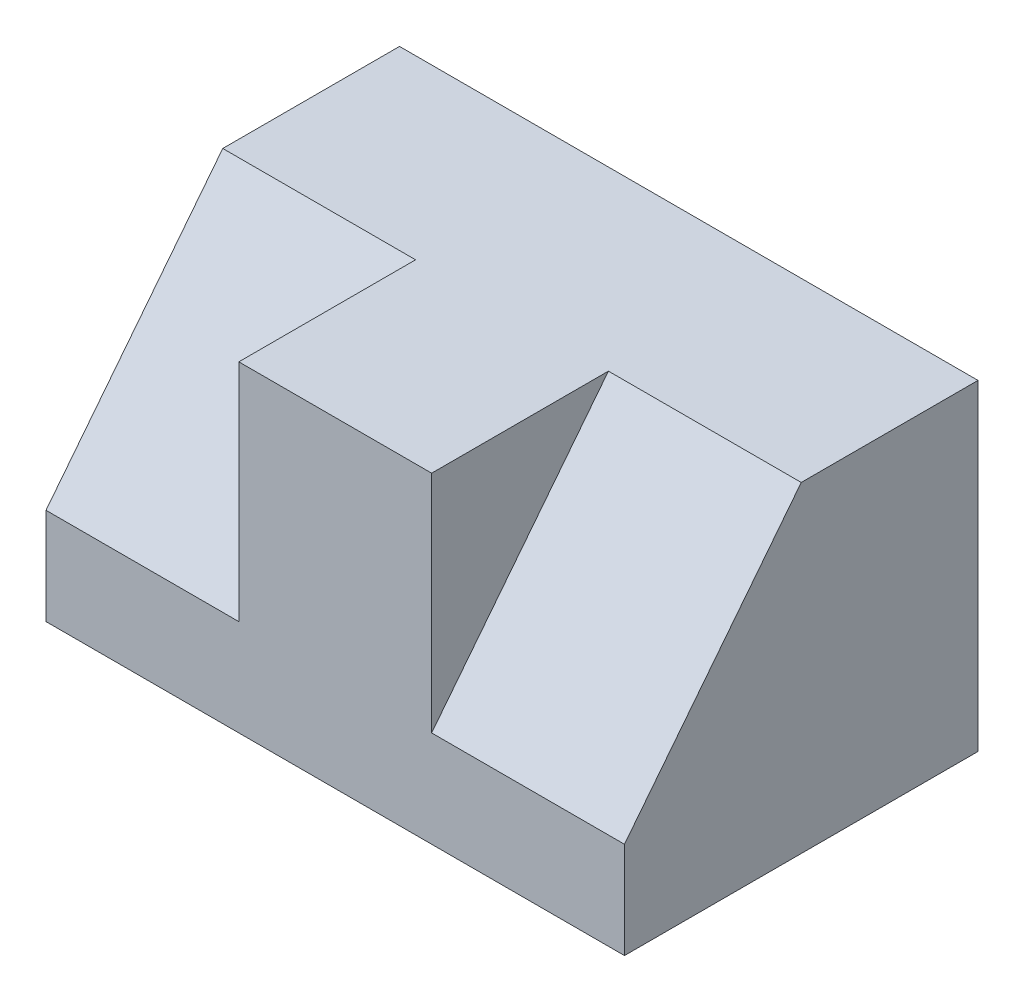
ISO-10303-21;
HEADER;
FILE_DESCRIPTION(('STEP AP214'),'2;1');
FILE_NAME('part.step','',(''),(''),'','','');
FILE_SCHEMA(('AUTOMOTIVE_DESIGN { 1 0 10303 214 1 1 1 1 }'));
ENDSEC;
DATA;
#1=APPLICATION_CONTEXT('core data for automotive mechanical design processes');
#2=APPLICATION_PROTOCOL_DEFINITION('international standard','automotive_design',2000,#1);
#3=PRODUCT_CONTEXT('',#1,'mechanical');
#4=PRODUCT('Part','Part','',(#3));
#5=PRODUCT_RELATED_PRODUCT_CATEGORY('part','',(#4));
#6=PRODUCT_DEFINITION_FORMATION('','',#4);
#7=PRODUCT_DEFINITION_CONTEXT('part definition',#1,'design');
#8=PRODUCT_DEFINITION('design','',#6,#7);
#9=PRODUCT_DEFINITION_SHAPE('','',#8);
#10=(LENGTH_UNIT() NAMED_UNIT(*) SI_UNIT(.MILLI.,.METRE.));
#11=(NAMED_UNIT(*) PLANE_ANGLE_UNIT() SI_UNIT($,.RADIAN.));
#12=(NAMED_UNIT(*) SI_UNIT($,.STERADIAN.) SOLID_ANGLE_UNIT());
#13=UNCERTAINTY_MEASURE_WITH_UNIT(LENGTH_MEASURE(1.E-05),#10,'distance_accuracy_value','');
#14=(GEOMETRIC_REPRESENTATION_CONTEXT(3) GLOBAL_UNCERTAINTY_ASSIGNED_CONTEXT((#13)) GLOBAL_UNIT_ASSIGNED_CONTEXT((#10,
#11,#12)) REPRESENTATION_CONTEXT('',''));
#15=CARTESIAN_POINT('',(0.,0.,0.));
#16=DIRECTION('',(0.,0.,1.));
#17=DIRECTION('',(1.,0.,0.));
#18=AXIS2_PLACEMENT_3D('',#15,#16,#17);
#19=CARTESIAN_POINT('',(0.,50.,0.));
#20=DIRECTION('',(1.,0.,0.));
#21=DIRECTION('',(0.,0.,-1.));
#22=AXIS2_PLACEMENT_3D('',#19,#20,#21);
#23=PLANE('',#22);
#24=DIRECTION('',(0.,-1.,0.));
#25=VECTOR('',#24,1.);
#26=CARTESIAN_POINT('',(0.,50.,0.));
#27=LINE('',#26,#25);
#28=CARTESIAN_POINT('',(0.,15.,0.));
#29=VERTEX_POINT('',#28);
#30=CARTESIAN_POINT('',(0.,0.,0.));
#31=VERTEX_POINT('',#30);
#32=EDGE_CURVE('E11',#29,#31,#27,.T.);
#33=ORIENTED_EDGE('',*,*,#32,.F.);
#34=DIRECTION('',(0.,-0.786318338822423,0.617821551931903));
#35=VECTOR('',#34,1.);
#36=CARTESIAN_POINT('',(0.,15.,0.));
#37=LINE('',#36,#35);
#38=CARTESIAN_POINT('',(0.,50.,-27.5));
#39=VERTEX_POINT('',#38);
#40=EDGE_CURVE('E171',#39,#29,#37,.T.);
#41=ORIENTED_EDGE('',*,*,#40,.F.);
#42=DIRECTION('',(0.,0.,1.));
#43=VECTOR('',#42,1.);
#44=CARTESIAN_POINT('',(0.,50.,0.));
#45=LINE('',#44,#43);
#46=CARTESIAN_POINT('',(0.,50.,-55.));
#47=VERTEX_POINT('',#46);
#48=EDGE_CURVE('E111',#47,#39,#45,.T.);
#49=ORIENTED_EDGE('',*,*,#48,.F.);
#50=DIRECTION('',(0.,-1.,0.));
#51=VECTOR('',#50,1.);
#52=CARTESIAN_POINT('',(0.,50.,-55.));
#53=LINE('',#52,#51);
#54=CARTESIAN_POINT('',(0.,0.,-55.));
#55=VERTEX_POINT('',#54);
#56=EDGE_CURVE('E137',#47,#55,#53,.T.);
#57=ORIENTED_EDGE('',*,*,#56,.T.);
#58=DIRECTION('',(0.,0.,1.));
#59=VECTOR('',#58,1.);
#60=CARTESIAN_POINT('',(0.,0.,0.));
#61=LINE('',#60,#59);
#62=EDGE_CURVE('E127',#55,#31,#61,.T.);
#63=ORIENTED_EDGE('',*,*,#62,.T.);
#64=EDGE_LOOP('',(#33,#41,#49,#57,#63));
#65=FACE_BOUND('',#64,.T.);
#66=ADVANCED_FACE('F31',(#65),#23,.F.);
#67=CARTESIAN_POINT('',(0.,50.,0.));
#68=DIRECTION('',(0.,0.,-1.));
#69=DIRECTION('',(-1.,0.,0.));
#70=AXIS2_PLACEMENT_3D('',#67,#68,#69);
#71=PLANE('',#70);
#72=DIRECTION('',(0.,1.,0.));
#73=VECTOR('',#72,1.);
#74=CARTESIAN_POINT('',(30.,50.,0.));
#75=LINE('',#74,#73);
#76=CARTESIAN_POINT('',(30.,15.,0.));
#77=VERTEX_POINT('',#76);
#78=CARTESIAN_POINT('',(30.,50.,0.));
#79=VERTEX_POINT('',#78);
#80=EDGE_CURVE('E45',#77,#79,#75,.T.);
#81=ORIENTED_EDGE('',*,*,#80,.F.);
#82=DIRECTION('',(-1.,0.,0.));
#83=VECTOR('',#82,1.);
#84=CARTESIAN_POINT('',(30.,15.,0.));
#85=LINE('',#84,#83);
#86=EDGE_CURVE('E106',#77,#29,#85,.T.);
#87=ORIENTED_EDGE('',*,*,#86,.T.);
#88=ORIENTED_EDGE('',*,*,#32,.T.);
#89=DIRECTION('',(1.,0.,0.));
#90=VECTOR('',#89,1.);
#91=CARTESIAN_POINT('',(0.,0.,0.));
#92=LINE('',#91,#90);
#93=CARTESIAN_POINT('',(90.,0.,0.));
#94=VERTEX_POINT('',#93);
#95=EDGE_CURVE('E140',#31,#94,#92,.T.);
#96=ORIENTED_EDGE('',*,*,#95,.T.);
#97=DIRECTION('',(0.,-1.,0.));
#98=VECTOR('',#97,1.);
#99=CARTESIAN_POINT('',(90.,50.,0.));
#100=LINE('',#99,#98);
#101=CARTESIAN_POINT('',(90.,15.,0.));
#102=VERTEX_POINT('',#101);
#103=EDGE_CURVE('E38',#102,#94,#100,.T.);
#104=ORIENTED_EDGE('',*,*,#103,.F.);
#105=DIRECTION('',(1.,0.,0.));
#106=VECTOR('',#105,1.);
#107=CARTESIAN_POINT('',(60.,15.,0.));
#108=LINE('',#107,#106);
#109=CARTESIAN_POINT('',(60.,15.,0.));
#110=VERTEX_POINT('',#109);
#111=EDGE_CURVE('E122',#110,#102,#108,.T.);
#112=ORIENTED_EDGE('',*,*,#111,.F.);
#113=DIRECTION('',(0.,-1.,0.));
#114=VECTOR('',#113,1.);
#115=CARTESIAN_POINT('',(60.,50.,0.));
#116=LINE('',#115,#114);
#117=CARTESIAN_POINT('',(60.,50.,0.));
#118=VERTEX_POINT('',#117);
#119=EDGE_CURVE('E117',#118,#110,#116,.T.);
#120=ORIENTED_EDGE('',*,*,#119,.F.);
#121=DIRECTION('',(1.,0.,0.));
#122=VECTOR('',#121,1.);
#123=CARTESIAN_POINT('',(0.,50.,0.));
#124=LINE('',#123,#122);
#125=EDGE_CURVE('E130',#79,#118,#124,.T.);
#126=ORIENTED_EDGE('',*,*,#125,.F.);
#127=EDGE_LOOP('',(#81,#87,#88,#96,#104,#112,#120,#126));
#128=FACE_BOUND('',#127,.T.);
#129=ADVANCED_FACE('F160',(#128),#71,.F.);
#130=CARTESIAN_POINT('',(90.,50.,0.));
#131=DIRECTION('',(-1.,0.,0.));
#132=DIRECTION('',(0.,0.,1.));
#133=AXIS2_PLACEMENT_3D('',#130,#131,#132);
#134=PLANE('',#133);
#135=DIRECTION('',(0.,0.,-1.));
#136=VECTOR('',#135,1.);
#137=CARTESIAN_POINT('',(90.,50.,0.));
#138=LINE('',#137,#136);
#139=CARTESIAN_POINT('',(90.,50.,-27.5));
#140=VERTEX_POINT('',#139);
#141=CARTESIAN_POINT('',(90.,50.,-55.));
#142=VERTEX_POINT('',#141);
#143=EDGE_CURVE('E133',#140,#142,#138,.T.);
#144=ORIENTED_EDGE('',*,*,#143,.F.);
#145=DIRECTION('',(0.,0.786318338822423,-0.617821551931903));
#146=VECTOR('',#145,1.);
#147=CARTESIAN_POINT('',(90.,15.,0.));
#148=LINE('',#147,#146);
#149=EDGE_CURVE('E113',#102,#140,#148,.T.);
#150=ORIENTED_EDGE('',*,*,#149,.F.);
#151=ORIENTED_EDGE('',*,*,#103,.T.);
#152=DIRECTION('',(0.,0.,-1.));
#153=VECTOR('',#152,1.);
#154=CARTESIAN_POINT('',(90.,0.,0.));
#155=LINE('',#154,#153);
#156=CARTESIAN_POINT('',(90.,0.,-55.));
#157=VERTEX_POINT('',#156);
#158=EDGE_CURVE('E143',#94,#157,#155,.T.);
#159=ORIENTED_EDGE('',*,*,#158,.T.);
#160=DIRECTION('',(0.,-1.,0.));
#161=VECTOR('',#160,1.);
#162=CARTESIAN_POINT('',(90.,50.,-55.));
#163=LINE('',#162,#161);
#164=EDGE_CURVE('E148',#142,#157,#163,.T.);
#165=ORIENTED_EDGE('',*,*,#164,.F.);
#166=EDGE_LOOP('',(#144,#150,#151,#159,#165));
#167=FACE_BOUND('',#166,.T.);
#168=ADVANCED_FACE('F154',(#167),#134,.F.);
#169=CARTESIAN_POINT('',(0.,50.,-55.));
#170=DIRECTION('',(0.,0.,1.));
#171=DIRECTION('',(1.,0.,0.));
#172=AXIS2_PLACEMENT_3D('',#169,#170,#171);
#173=PLANE('',#172);
#174=DIRECTION('',(-1.,0.,0.));
#175=VECTOR('',#174,1.);
#176=CARTESIAN_POINT('',(0.,0.,-55.));
#177=LINE('',#176,#175);
#178=EDGE_CURVE('E131',#157,#55,#177,.T.);
#179=ORIENTED_EDGE('',*,*,#178,.T.);
#180=ORIENTED_EDGE('',*,*,#56,.F.);
#181=DIRECTION('',(-1.,0.,0.));
#182=VECTOR('',#181,1.);
#183=CARTESIAN_POINT('',(0.,50.,-55.));
#184=LINE('',#183,#182);
#185=EDGE_CURVE('E135',#142,#47,#184,.T.);
#186=ORIENTED_EDGE('',*,*,#185,.F.);
#187=ORIENTED_EDGE('',*,*,#164,.T.);
#188=EDGE_LOOP('',(#179,#180,#186,#187));
#189=FACE_BOUND('',#188,.T.);
#190=ADVANCED_FACE('F168',(#189),#173,.F.);
#191=CARTESIAN_POINT('',(0.,50.,-55.));
#192=DIRECTION('',(0.,-1.,0.));
#193=DIRECTION('',(0.,0.,-1.));
#194=AXIS2_PLACEMENT_3D('',#191,#192,#193);
#195=PLANE('',#194);
#196=ORIENTED_EDGE('',*,*,#48,.T.);
#197=DIRECTION('',(-1.,0.,0.));
#198=VECTOR('',#197,1.);
#199=CARTESIAN_POINT('',(30.,50.,-27.5));
#200=LINE('',#199,#198);
#201=CARTESIAN_POINT('',(30.,50.,-27.5));
#202=VERTEX_POINT('',#201);
#203=EDGE_CURVE('E103',#202,#39,#200,.T.);
#204=ORIENTED_EDGE('',*,*,#203,.F.);
#205=DIRECTION('',(0.,0.,-1.));
#206=VECTOR('',#205,1.);
#207=CARTESIAN_POINT('',(30.,50.,-27.5));
#208=LINE('',#207,#206);
#209=EDGE_CURVE('E93',#79,#202,#208,.T.);
#210=ORIENTED_EDGE('',*,*,#209,.F.);
#211=ORIENTED_EDGE('',*,*,#125,.T.);
#212=DIRECTION('',(0.,0.,1.));
#213=VECTOR('',#212,1.);
#214=CARTESIAN_POINT('',(60.,50.,0.));
#215=LINE('',#214,#213);
#216=CARTESIAN_POINT('',(60.,50.,-27.5));
#217=VERTEX_POINT('',#216);
#218=EDGE_CURVE('E120',#217,#118,#215,.T.);
#219=ORIENTED_EDGE('',*,*,#218,.F.);
#220=DIRECTION('',(1.,0.,0.));
#221=VECTOR('',#220,1.);
#222=CARTESIAN_POINT('',(60.,50.,-27.5));
#223=LINE('',#222,#221);
#224=EDGE_CURVE('E124',#217,#140,#223,.T.);
#225=ORIENTED_EDGE('',*,*,#224,.T.);
#226=ORIENTED_EDGE('',*,*,#143,.T.);
#227=ORIENTED_EDGE('',*,*,#185,.T.);
#228=EDGE_LOOP('',(#196,#204,#210,#211,#219,#225,#226,#227));
#229=FACE_BOUND('',#228,.T.);
#230=ADVANCED_FACE('F109',(#229),#195,.F.);
#231=CARTESIAN_POINT('',(0.,0.,-55.));
#232=DIRECTION('',(0.,-1.,0.));
#233=DIRECTION('',(0.,0.,-1.));
#234=AXIS2_PLACEMENT_3D('',#231,#232,#233);
#235=PLANE('',#234);
#236=ORIENTED_EDGE('',*,*,#62,.F.);
#237=ORIENTED_EDGE('',*,*,#178,.F.);
#238=ORIENTED_EDGE('',*,*,#158,.F.);
#239=ORIENTED_EDGE('',*,*,#95,.F.);
#240=EDGE_LOOP('',(#236,#237,#238,#239));
#241=FACE_BOUND('',#240,.T.);
#242=ADVANCED_FACE('F165',(#241),#235,.T.);
#243=CARTESIAN_POINT('',(60.,15.,0.));
#244=DIRECTION('',(0.,-0.617821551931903,-0.786318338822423));
#245=DIRECTION('',(0.,0.786318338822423,-0.617821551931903));
#246=AXIS2_PLACEMENT_3D('',#243,#244,#245);
#247=PLANE('',#246);
#248=ORIENTED_EDGE('',*,*,#149,.T.);
#249=ORIENTED_EDGE('',*,*,#224,.F.);
#250=DIRECTION('',(0.,0.786318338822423,-0.617821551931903));
#251=VECTOR('',#250,1.);
#252=CARTESIAN_POINT('',(60.,15.,0.));
#253=LINE('',#252,#251);
#254=EDGE_CURVE('E53',#110,#217,#253,.T.);
#255=ORIENTED_EDGE('',*,*,#254,.F.);
#256=ORIENTED_EDGE('',*,*,#111,.T.);
#257=EDGE_LOOP('',(#248,#249,#255,#256));
#258=FACE_BOUND('',#257,.T.);
#259=ADVANCED_FACE('F177',(#258),#247,.F.);
#260=CARTESIAN_POINT('',(60.,50.,0.));
#261=DIRECTION('',(1.,0.,0.));
#262=DIRECTION('',(0.,0.,-1.));
#263=AXIS2_PLACEMENT_3D('',#260,#261,#262);
#264=PLANE('',#263);
#265=ORIENTED_EDGE('',*,*,#119,.T.);
#266=ORIENTED_EDGE('',*,*,#254,.T.);
#267=ORIENTED_EDGE('',*,*,#218,.T.);
#268=EDGE_LOOP('',(#265,#266,#267));
#269=FACE_BOUND('',#268,.T.);
#270=ADVANCED_FACE('F175',(#269),#264,.T.);
#271=CARTESIAN_POINT('',(30.,15.,0.));
#272=DIRECTION('',(0.,-0.617821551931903,-0.786318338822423));
#273=DIRECTION('',(0.,0.786318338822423,-0.617821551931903));
#274=AXIS2_PLACEMENT_3D('',#271,#272,#273);
#275=PLANE('',#274);
#276=ORIENTED_EDGE('',*,*,#40,.T.);
#277=ORIENTED_EDGE('',*,*,#86,.F.);
#278=DIRECTION('',(0.,-0.786318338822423,0.617821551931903));
#279=VECTOR('',#278,1.);
#280=CARTESIAN_POINT('',(30.,15.,0.));
#281=LINE('',#280,#279);
#282=EDGE_CURVE('E96',#202,#77,#281,.T.);
#283=ORIENTED_EDGE('',*,*,#282,.F.);
#284=ORIENTED_EDGE('',*,*,#203,.T.);
#285=EDGE_LOOP('',(#276,#277,#283,#284));
#286=FACE_BOUND('',#285,.T.);
#287=ADVANCED_FACE('F102',(#286),#275,.F.);
#288=CARTESIAN_POINT('',(30.,50.,0.));
#289=DIRECTION('',(-1.,0.,0.));
#290=DIRECTION('',(0.,0.,1.));
#291=AXIS2_PLACEMENT_3D('',#288,#289,#290);
#292=PLANE('',#291);
#293=ORIENTED_EDGE('',*,*,#80,.T.);
#294=ORIENTED_EDGE('',*,*,#209,.T.);
#295=ORIENTED_EDGE('',*,*,#282,.T.);
#296=EDGE_LOOP('',(#293,#294,#295));
#297=FACE_BOUND('',#296,.T.);
#298=ADVANCED_FACE('F95',(#297),#292,.T.);
#299=CLOSED_SHELL('',(#66,#129,#168,#190,#230,#242,#259,#270,#287,#298));
#300=MANIFOLD_SOLID_BREP('B2',#299);
#301=ADVANCED_BREP_SHAPE_REPRESENTATION('',(#18,#300),#14);
#302=SHAPE_DEFINITION_REPRESENTATION(#9,#301);
ENDSEC;
END-ISO-10303-21;
